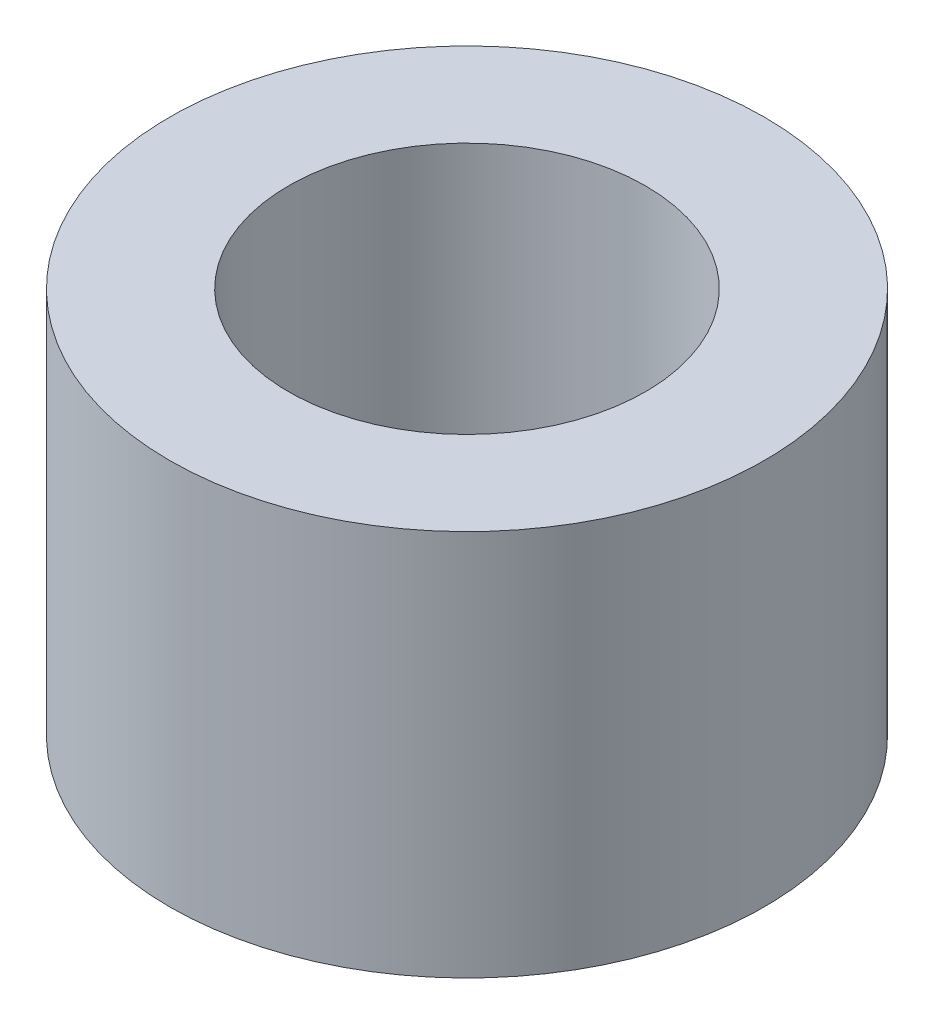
from build123d import *

# Parameters (mm, degrees)
SKETCH1_R      = 5
SKETCH1_R_2    = 3
EXTRUDE1_DEPTH = 6.5


with BuildPart() as part:
    # Sketch1 → Extrude1 (new body)
    with BuildSketch(Plane(origin=(0, 0, 0), x_dir=(1, 0, 0), z_dir=(0, 1, 0))):
        with Locations(Location((0, 0, 0), (0, 0, 90))):
            Circle(SKETCH1_R)
        with Locations(Location((0, 0, 0), (0, 0, 90))):
            Circle(SKETCH1_R_2, mode=Mode.SUBTRACT)
    extrude(amount=EXTRUDE1_DEPTH)


solid = part.part
